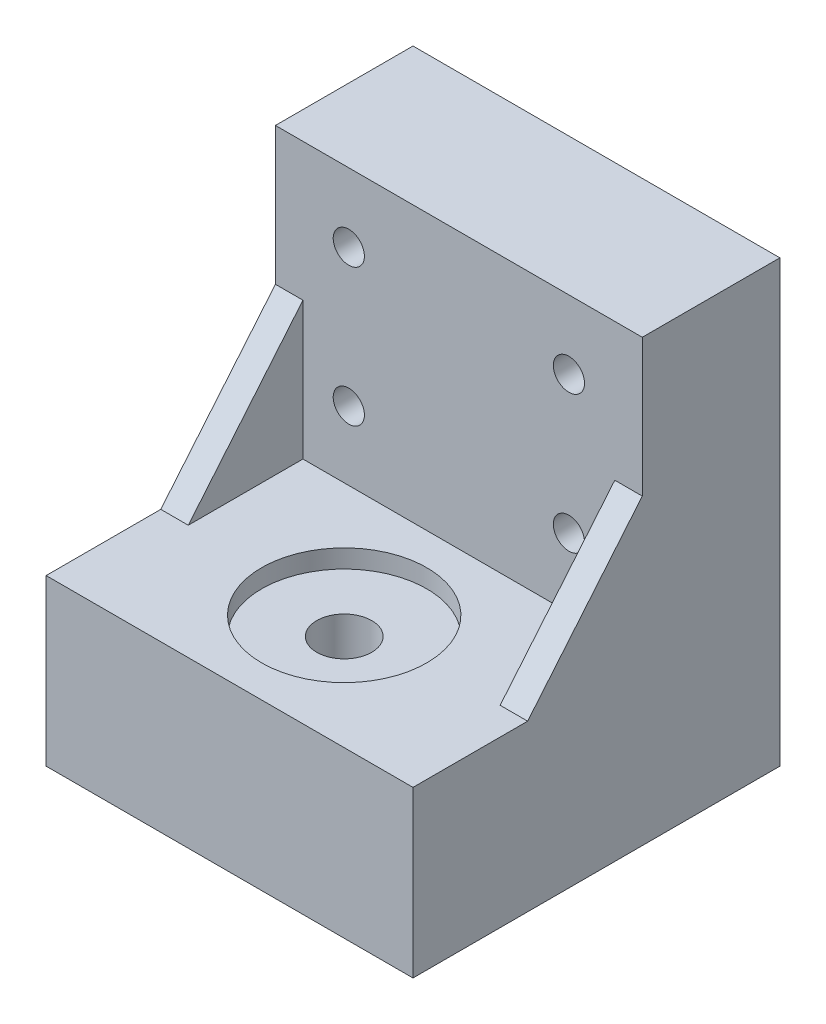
from build123d import *

# Parameters (mm, degrees)
SKETCH1_W            = 40
SKETCH1_H            = 40
BOSS_EXTRUDE1_DEPTH  = 18
SKETCH3_W            = 40
SKETCH3_H            = 15
BOSS_EXTRUDE2_DEPTH  = 30
SKETCH4_R            = 9
CUT_EXTRUDE1_DEPTH   = 2
SKETCH5_R            = 3
CUT_EXTRUDE2_DEPTH   = 65.992307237
SKETCH6_R            = 1.7
CUT_EXTRUDE3_DEPTH   = 56.901699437
LPATTERN1_COUNT      = 2
LPATTERN1_PITCH      = 24
LPATTERN1_COUNT_DIR2 = 2
LPATTERN1_PITCH_DIR2 = 15
BOSS_EXTRUDE4_DEPTH  = 3
BOSS_EXTRUDE5_DEPTH  = 3


with BuildPart() as part:
    # Sketch1 → Boss-Extrude1 (new body)
    with BuildSketch(Plane(origin=(0, 0, 0), x_dir=(1, 0, 0), z_dir=(0, 1, 0))):
        with Locations((20, 20)):
            Rectangle(SKETCH1_W, SKETCH1_H)
    extrude(amount=-BOSS_EXTRUDE1_DEPTH)

    # Sketch3 → Boss-Extrude2 (add)
    with BuildSketch(Plane(origin=(0, 0, 0), x_dir=(1, 0, 0), z_dir=(0, 1, 0))):
        with Locations((20, 32.5)):
            Rectangle(SKETCH3_W, SKETCH3_H)
    extrude(amount=BOSS_EXTRUDE2_DEPTH)

    # Sketch4 → Cut-Extrude1 (cut)
    with BuildSketch(Plane(origin=(0, 0, 0), x_dir=(1, 0, 0), z_dir=(0, 1, 0))):
        with Locations(Location((20, 12.5, 0), (0, 0, 270))):
            Circle(SKETCH4_R)
    extrude(amount=-CUT_EXTRUDE1_DEPTH, mode=Mode.SUBTRACT)

    # Sketch5 → Cut-Extrude2 (cut, through all)
    with BuildSketch(Plane(origin=(0, -2, 0), x_dir=(1, 0, 0), z_dir=(0, 1, 0))):
        with Locations(Location((20, 12.5, 0), (0, 0, 270))):
            Circle(SKETCH5_R)
    extrude(amount=-CUT_EXTRUDE2_DEPTH, mode=Mode.SUBTRACT)

    # Sketch6 → Cut-Extrude3 (cut, through all)
    with BuildSketch(Plane.XY.offset(-25)):
        with Locations((8, 22.5)):
            Circle(SKETCH6_R)
    cut_extrude3 = extrude(amount=-CUT_EXTRUDE3_DEPTH, mode=Mode.SUBTRACT)

    # LPattern1: Cut-Extrude3 2 × 2
    with Locations(*[(i * LPATTERN1_PITCH, -j * LPATTERN1_PITCH_DIR2, 0) for i in range(LPATTERN1_COUNT) for j in range(LPATTERN1_COUNT_DIR2) if (i, j) != (0, 0)]):
        add(cut_extrude3, mode=Mode.SUBTRACT)

    # Sketch8 → Boss-Extrude4 (add)
    with BuildSketch(Plane(origin=(40, 0, 0), x_dir=(0, 0, -1), z_dir=(1, 0, 0))):
        Polygon((25, 15), (12.5, 0), (25, 0), align=None)
    extrude(amount=-BOSS_EXTRUDE4_DEPTH)

    # Sketch9 → Boss-Extrude5 (add)
    with BuildSketch(Plane.ZY):
        Polygon((-25, 15), (-12.5, 0), (-25, 0), align=None)
    extrude(amount=-BOSS_EXTRUDE5_DEPTH)


solid = part.part
